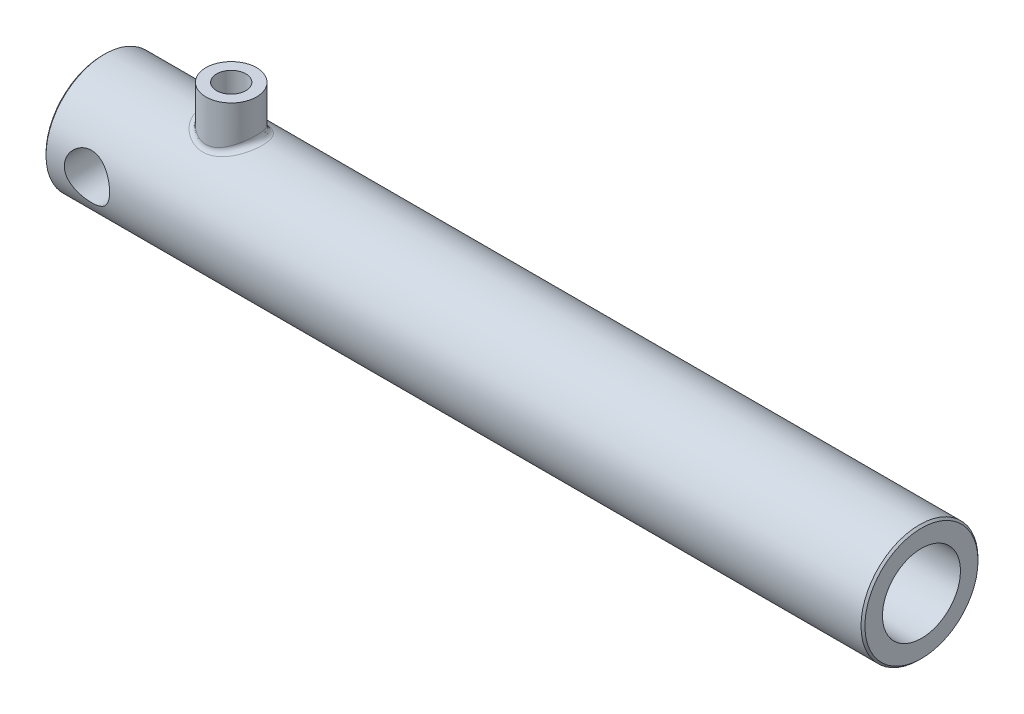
from build123d import *

# Parameters (mm, degrees)
ESQUISSE1_W                     = 420
ESQUISSE1_H                     = 30
ESQUISSE2_W                     = 13
ESQUISSE2_H                     = 22.962988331
DIAM_TRE_DU_PER_AGE_6_8_6_8_1_D = 6.8
CHANFREIN1_SIZE                 = 1
CONG_1_R                        = 2.999965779
ESQUISSE10_W                    = 60
ESQUISSE10_H                    = 11.625
ENL_V_MAT_EXTRU_1_REACH         = 333.21
ENL_V_MAT_EXTRU_1_END_RADIUS    = 25
ESQUISSE11_R                    = 7.5


with BuildPart() as part:
    # Esquisse1 → R_volution1 (revolve)
    with BuildSketch(Plane(origin=(0, 0, 0), x_dir=(-1, 0, 0), z_dir=(0, 0, -1)), mode=Mode.PRIVATE) as r_volution1_sk:
        with Locations((-110, 15)):
            Rectangle(ESQUISSE1_W, ESQUISSE1_H)
    revolve(r_volution1_sk.sketch.rotate(Axis((320, 0, 0), (-1, 0, 0)), 270), axis=Axis((320, 0, 0), (-1, 0, 0)))

    # Esquisse2 → R_volution2 (revolve)
    with BuildSketch(Plane(origin=(-34, 0, 0), x_dir=(0, 0, -1), z_dir=(1, 0, 0))):
        with Locations((6.5, 38.518505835)):
            Rectangle(ESQUISSE2_W, ESQUISSE2_H)
    revolve(axis=Axis((-34, 50, 0), (0, -1, 0)))

    # Diam_tre du per_age _6.8 _6.8_1 (through all)
    with Locations(Plane.ZY.offset(100)):
        with Locations((0, 0)):
            Hole(DIAM_TRE_DU_PER_AGE_6_8_6_8_1_D / 2)

    # Esquisse6 → Chambrage pour vis _ t_te hexagonale M48 (revolve, cut)
    with BuildSketch(Plane(origin=(320, 0, 0), x_dir=(0, 0, -1), z_dir=(0, 1, 0))):
        Polygon((0, 0), (0, 372), (25, 372), (25, 59), (20, 59), (20, 0), align=None)
    revolve(axis=Axis((326.35, 0, 0), (-1, 0, 0)), mode=Mode.SUBTRACT)

    # Chanfrein1
    chanfrein1_edges = [part.edges().sort_by_distance(p)[0] for p in [
        (-100, 0, -30),
        (320, 0, -30),
    ]]
    chamfer(chanfrein1_edges, length=CHANFREIN1_SIZE)

    # Cong_1
    cong_1_edges = [part.edges().sort_by_distance(p)[0] for p in [
        (-34, 27.037011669, 13),
    ]]
    fillet(cong_1_edges, radius=CONG_1_R)

    # Esquisse10 → Enl_vement de mati_re-R_volution3 (revolve, cut)
    with BuildSketch(Plane(origin=(-78, 0, 0), x_dir=(0, 0, -1), z_dir=(1, 0, 0)), mode=Mode.PRIVATE) as enl_vement_de_mati_re_r_volution3_sk:
        with Locations((0, 5.8125)):
            Rectangle(ESQUISSE10_W, ESQUISSE10_H)
    revolve(enl_vement_de_mati_re_r_volution3_sk.sketch.rotate(Axis((-78, 0, 36.375745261), (0, 0, -1)), 90), axis=Axis((-78, 0, 36.375745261), (0, 0, -1)), mode=Mode.SUBTRACT)

    # Enl_v. mat.-Extru.1: up to this cylinder (the profile starts outside it)
    enl_v_mat_extru_1_end = Plane(origin=(-34, 0, 0), z_dir=(1, 0, 0)) * Cylinder(ENL_V_MAT_EXTRU_1_END_RADIUS, 717.42, mode=Mode.PRIVATE)
    # Esquisse11 → Enl_v. mat.-Extru.1 (cut, up to the surface)
    with BuildSketch(Plane(origin=(0, 50, 0), x_dir=(1, 0, 0), z_dir=(0, 1, 0)), mode=Mode.PRIVATE) as enl_v_mat_extru_1_sk1:
        with Locations(Location((-34, 0, 0), (0, 0, 270))):
            Circle(ESQUISSE11_R)
    enl_v_mat_extru_1_tool1 = extrude(enl_v_mat_extru_1_sk1.sketch, amount=-ENL_V_MAT_EXTRU_1_REACH, mode=Mode.PRIVATE) - enl_v_mat_extru_1_end
    add(enl_v_mat_extru_1_tool1.solids().sort_by_distance((-34, 50, 0))[0], mode=Mode.SUBTRACT)


solid = part.part
